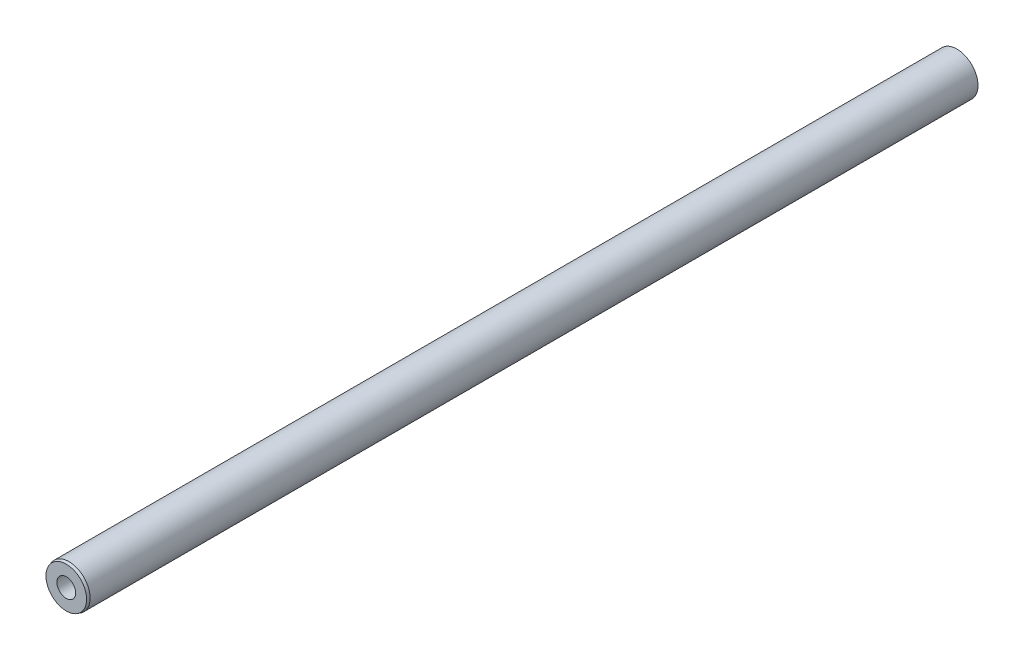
ISO-10303-21;
HEADER;
FILE_DESCRIPTION(('STEP AP214'),'2;1');
FILE_NAME('part.step','',(''),(''),'','','');
FILE_SCHEMA(('AUTOMOTIVE_DESIGN { 1 0 10303 214 1 1 1 1 }'));
ENDSEC;
DATA;
#1=APPLICATION_CONTEXT('core data for automotive mechanical design processes');
#2=APPLICATION_PROTOCOL_DEFINITION('international standard','automotive_design',2000,#1);
#3=PRODUCT_CONTEXT('',#1,'mechanical');
#4=PRODUCT('Part','Part','',(#3));
#5=PRODUCT_RELATED_PRODUCT_CATEGORY('part','',(#4));
#6=PRODUCT_DEFINITION_FORMATION('','',#4);
#7=PRODUCT_DEFINITION_CONTEXT('part definition',#1,'design');
#8=PRODUCT_DEFINITION('design','',#6,#7);
#9=PRODUCT_DEFINITION_SHAPE('','',#8);
#10=(LENGTH_UNIT() NAMED_UNIT(*) SI_UNIT(.MILLI.,.METRE.));
#11=(NAMED_UNIT(*) PLANE_ANGLE_UNIT() SI_UNIT($,.RADIAN.));
#12=(NAMED_UNIT(*) SI_UNIT($,.STERADIAN.) SOLID_ANGLE_UNIT());
#13=UNCERTAINTY_MEASURE_WITH_UNIT(LENGTH_MEASURE(1.E-05),#10,'distance_accuracy_value','');
#14=(GEOMETRIC_REPRESENTATION_CONTEXT(3) GLOBAL_UNCERTAINTY_ASSIGNED_CONTEXT((#13)) GLOBAL_UNIT_ASSIGNED_CONTEXT((#10,
#11,#12)) REPRESENTATION_CONTEXT('',''));
#15=CARTESIAN_POINT('',(0.,0.,0.));
#16=DIRECTION('',(0.,0.,1.));
#17=DIRECTION('',(1.,0.,0.));
#18=AXIS2_PLACEMENT_3D('',#15,#16,#17);
#19=CARTESIAN_POINT('',(0.,0.,402.9456));
#20=DIRECTION('',(0.,0.,-1.));
#21=DIRECTION('',(-1.,0.,0.));
#22=AXIS2_PLACEMENT_3D('',#19,#20,#21);
#23=CYLINDRICAL_SURFACE('',#22,9.525);
#24=CARTESIAN_POINT('',(0.,0.,401.6756));
#25=DIRECTION('',(0.,0.,1.));
#26=DIRECTION('',(1.,0.,0.));
#27=AXIS2_PLACEMENT_3D('',#24,#25,#26);
#28=CIRCLE('',#27,9.525);
#29=CARTESIAN_POINT('',(9.525,0.,401.6756));
#30=VERTEX_POINT('',#29);
#31=EDGE_CURVE('E11',#30,#30,#28,.F.);
#32=ORIENTED_EDGE('',*,*,#31,.T.);
#33=EDGE_LOOP('',(#32));
#34=FACE_BOUND('',#33,.T.);
#35=CARTESIAN_POINT('',(0.,0.,0.));
#36=DIRECTION('',(0.,0.,1.));
#37=DIRECTION('',(1.,0.,0.));
#38=AXIS2_PLACEMENT_3D('',#35,#36,#37);
#39=CIRCLE('',#38,9.525);
#40=CARTESIAN_POINT('',(9.525,0.,0.));
#41=VERTEX_POINT('',#40);
#42=EDGE_CURVE('E67',#41,#41,#39,.T.);
#43=ORIENTED_EDGE('',*,*,#42,.T.);
#44=EDGE_LOOP('',(#43));
#45=FACE_BOUND('',#44,.T.);
#46=ADVANCED_FACE('F45',(#34,#45),#23,.T.);
#47=CARTESIAN_POINT('',(0.,0.,402.9456));
#48=DIRECTION('',(0.,0.,1.));
#49=DIRECTION('',(1.,0.,0.));
#50=AXIS2_PLACEMENT_3D('',#47,#48,#49);
#51=PLANE('',#50);
#52=CARTESIAN_POINT('',(0.,0.,402.9456));
#53=DIRECTION('',(0.,0.,1.));
#54=DIRECTION('',(1.,0.,0.));
#55=AXIS2_PLACEMENT_3D('',#52,#53,#54);
#56=CIRCLE('',#55,4.25);
#57=CARTESIAN_POINT('',(4.25,0.,402.9456));
#58=VERTEX_POINT('',#57);
#59=EDGE_CURVE('E64',#58,#58,#56,.T.);
#60=ORIENTED_EDGE('',*,*,#59,.F.);
#61=EDGE_LOOP('',(#60));
#62=FACE_BOUND('',#61,.T.);
#63=CARTESIAN_POINT('',(0.,0.,402.9456));
#64=DIRECTION('',(0.,0.,1.));
#65=DIRECTION('',(1.,0.,0.));
#66=AXIS2_PLACEMENT_3D('',#63,#64,#65);
#67=CIRCLE('',#66,9.18470452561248);
#68=CARTESIAN_POINT('',(9.18470452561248,0.,402.9456));
#69=VERTEX_POINT('',#68);
#70=EDGE_CURVE('E52',#69,#69,#67,.T.);
#71=ORIENTED_EDGE('',*,*,#70,.T.);
#72=EDGE_LOOP('',(#71));
#73=FACE_BOUND('',#72,.T.);
#74=ADVANCED_FACE('F74',(#62,#73),#51,.T.);
#75=CARTESIAN_POINT('',(0.,0.,0.));
#76=DIRECTION('',(0.,0.,1.));
#77=DIRECTION('',(1.,0.,0.));
#78=AXIS2_PLACEMENT_3D('',#75,#76,#77);
#79=PLANE('',#78);
#80=ORIENTED_EDGE('',*,*,#42,.F.);
#81=EDGE_LOOP('',(#80));
#82=FACE_BOUND('',#81,.T.);
#83=ADVANCED_FACE('F77',(#82),#79,.F.);
#84=CARTESIAN_POINT('',(0.,0.,402.9456));
#85=DIRECTION('',(0.,0.,-1.));
#86=DIRECTION('',(-1.,0.,0.));
#87=AXIS2_PLACEMENT_3D('',#84,#85,#86);
#88=CONICAL_SURFACE('',#87,9.18470452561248,0.261799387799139);
#89=ORIENTED_EDGE('',*,*,#31,.F.);
#90=EDGE_LOOP('',(#89));
#91=FACE_BOUND('',#90,.T.);
#92=ORIENTED_EDGE('',*,*,#70,.F.);
#93=EDGE_LOOP('',(#92));
#94=FACE_BOUND('',#93,.T.);
#95=ADVANCED_FACE('F47',(#91,#94),#88,.T.);
#96=CARTESIAN_POINT('',(0.,0.,402.9456));
#97=DIRECTION('',(0.,0.,1.));
#98=DIRECTION('',(1.,0.,0.));
#99=AXIS2_PLACEMENT_3D('',#96,#97,#98);
#100=CYLINDRICAL_SURFACE('',#99,4.24999999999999);
#101=CARTESIAN_POINT('',(0.,0.,382.9456));
#102=DIRECTION('',(0.,0.,1.));
#103=DIRECTION('',(1.,0.,0.));
#104=AXIS2_PLACEMENT_3D('',#101,#102,#103);
#105=CIRCLE('',#104,4.24999999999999);
#106=CARTESIAN_POINT('',(4.24999999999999,0.,382.9456));
#107=VERTEX_POINT('',#106);
#108=EDGE_CURVE('E62',#107,#107,#105,.T.);
#109=ORIENTED_EDGE('',*,*,#108,.F.);
#110=EDGE_LOOP('',(#109));
#111=FACE_BOUND('',#110,.T.);
#112=ORIENTED_EDGE('',*,*,#59,.T.);
#113=EDGE_LOOP('',(#112));
#114=FACE_BOUND('',#113,.T.);
#115=ADVANCED_FACE('F58',(#111,#114),#100,.F.);
#116=CARTESIAN_POINT('',(0.,0.,382.9456));
#117=DIRECTION('',(0.,0.,1.));
#118=DIRECTION('',(1.,0.,0.));
#119=AXIS2_PLACEMENT_3D('',#116,#117,#118);
#120=CONICAL_SURFACE('',#119,4.24999999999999,1.02974425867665);
#121=CARTESIAN_POINT('',(0.,0.,380.391942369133));
#122=VERTEX_POINT('',#121);
#123=VERTEX_LOOP('',#122);
#124=FACE_BOUND('',#123,.T.);
#125=ORIENTED_EDGE('',*,*,#108,.T.);
#126=EDGE_LOOP('',(#125));
#127=FACE_BOUND('',#126,.T.);
#128=ADVANCED_FACE('F55',(#124,#127),#120,.F.);
#129=CLOSED_SHELL('',(#46,#74,#83,#95,#115,#128));
#130=MANIFOLD_SOLID_BREP('B2',#129);
#131=ADVANCED_BREP_SHAPE_REPRESENTATION('',(#18,#130),#14);
#132=SHAPE_DEFINITION_REPRESENTATION(#9,#131);
ENDSEC;
END-ISO-10303-21;
